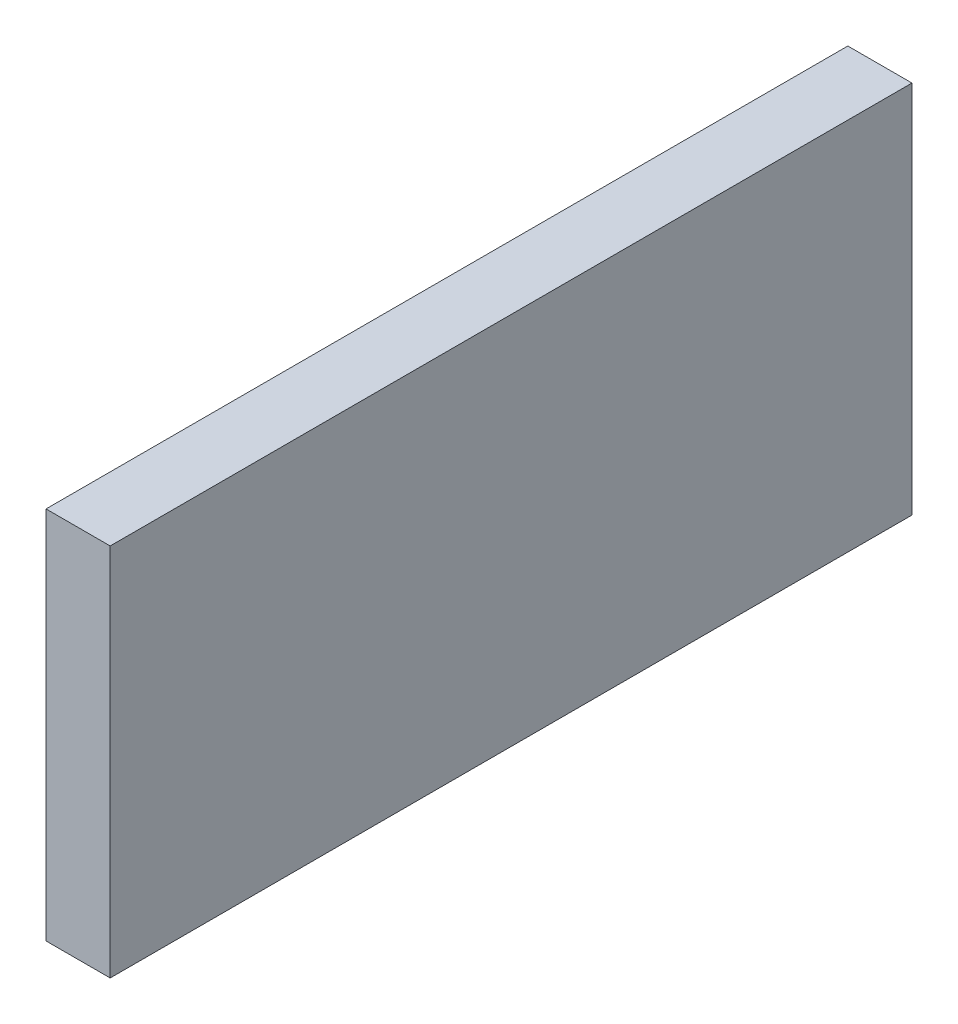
from build123d import *

# Parameters (mm, degrees)
SKETCH1_W           = 150
SKETCH1_H           = 70
BOSS_EXTRUDE1_DEPTH = 12


with BuildPart() as part:
    # Sketch1 → Boss-Extrude1 (new body)
    with BuildSketch(Plane(origin=(0, 0, 0), x_dir=(0, 0, -1), z_dir=(1, 0, 0))):
        with Locations((75, 35)):
            Rectangle(SKETCH1_W, SKETCH1_H)
    extrude(amount=BOSS_EXTRUDE1_DEPTH)


solid = part.part
